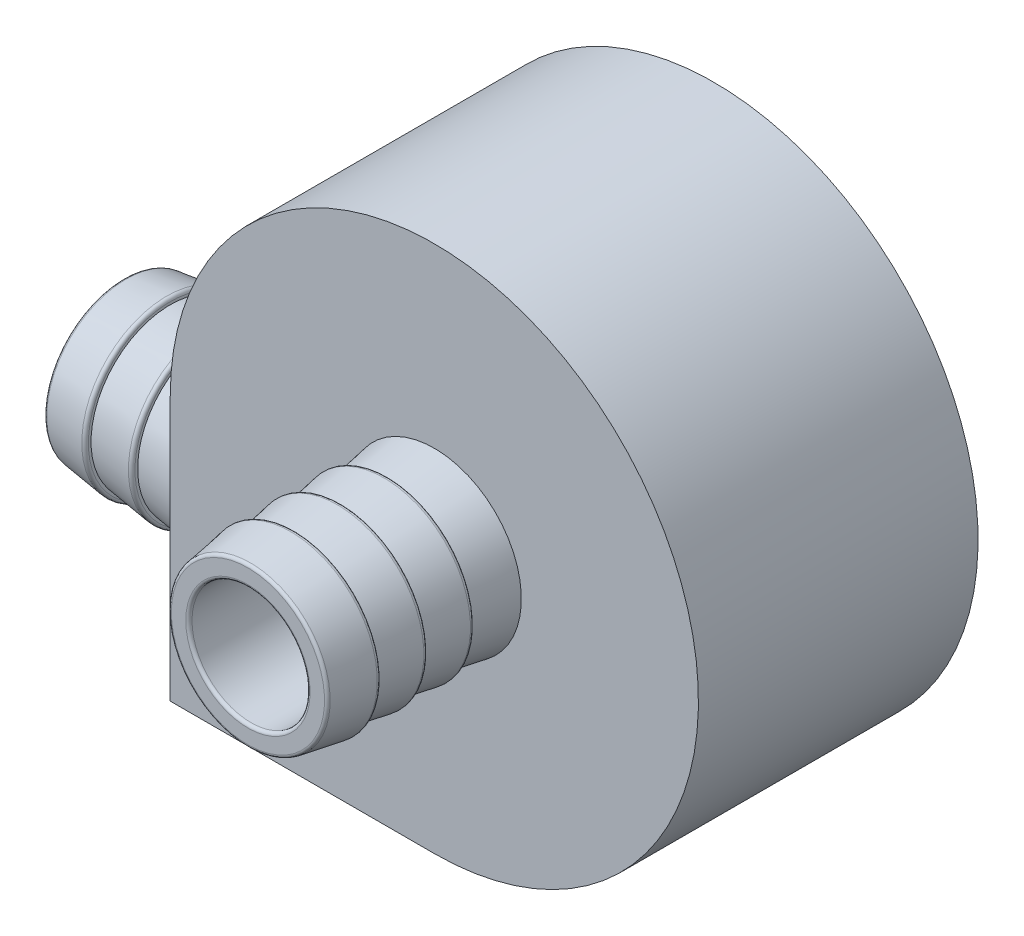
from build123d import *

# Parameters (mm, degrees)
BOSS_EXTRUDE1_DEPTH = 22.86
SKETCH4_R           = 4.826
CUT_EXTRUDE1_DEPTH  = 39.142309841
SKETCH7_R           = 17.156517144
CUT_EXTRUDE2_DEPTH  = 20.32
SKETCH9_R           = 4.953
CUT_EXTRUDE3_DEPTH  = 12.7


with BuildPart() as part:
    # Sketch1 → Boss-Extrude1 (new body)
    with BuildSketch(Plane.XY):
        with BuildLine():
            Line((0, -21.59), (-21.59, -21.59))
            Line((-21.59, -21.59), (-21.59, 0))
            ThreePointArc((-21.59, 0), (15.266435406, 15.266435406), (0, -21.59))
        make_face()
    extrude(amount=BOSS_EXTRUDE1_DEPTH)

    # Sketch3 → Revolve1 (revolve)
    with BuildSketch(Plane(origin=(0, 0, 0), x_dir=(1, 0, 0), z_dir=(0, 1, 0)), mode=Mode.PRIVATE) as revolve1_sk:
        with BuildLine():
            Line((4.826, -22.86), (7.112, -22.86))
            Line((7.112, -22.86), (6.477, -26.67))
            Line((6.477, -26.67), (6.812163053, -26.67))
            ThreePointArc((6.812163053, -26.67), (7.005970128, -26.759820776), (7.06270711, -26.965757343))
            Line((7.06270711, -26.965757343), (6.477, -30.48))
            Line((6.477, -30.48), (6.812163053, -30.48))
            ThreePointArc((6.812163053, -30.48), (7.005970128, -30.569820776), (7.06270711, -30.775757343))
            Line((7.06270711, -30.775757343), (6.477, -34.29))
            Line((6.477, -34.29), (6.812163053, -34.29))
            ThreePointArc((6.812163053, -34.29), (7.005970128, -34.379820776), (7.06270711, -34.585757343))
            Line((7.06270711, -34.585757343), (6.512373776, -37.887757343))
            ThreePointArc((6.512373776, -37.887757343), (6.426008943, -38.039807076), (6.26182972, -38.1))
            Line((6.26182972, -38.1), (5.08, -38.1))
            ThreePointArc((5.08, -38.1), (4.900394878, -38.025605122), (4.826, -37.846))
            Line((4.826, -37.846), (4.826, -22.86))
        make_face()
    revolve(revolve1_sk.sketch.rotate(Axis((0, 0, 22.86), (0, 0, 1)), 180), axis=Axis((0, 0, 22.86), (0, 0, 1)))

    # Sketch4 → Cut-Extrude1 (cut, through all)
    with BuildSketch(Plane.XY.offset(22.86)):
        with Locations(Location((0, 0, 0), (0, 0, 180))):
            Circle(SKETCH4_R)
    extrude(amount=-CUT_EXTRUDE1_DEPTH, mode=Mode.SUBTRACT)

    # Sketch7 → Cut-Extrude2 (cut)
    with BuildSketch(Plane(origin=(0, 0, 0), x_dir=(-1, 0, 0), z_dir=(0, 0, -1))):
        Circle(SKETCH7_R)
    extrude(amount=-CUT_EXTRUDE2_DEPTH, mode=Mode.SUBTRACT)

    # Sketch8 → Revolve3 (revolve)
    with BuildSketch(Plane.XZ.offset(11.43)):
        with BuildLine():
            Line((-21.59, 6.477), (-36.576, 6.477))
            ThreePointArc((-36.576, 6.477), (-36.755605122, 6.402605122), (-36.83, 6.223))
            Line((-36.83, 6.223), (-36.83, 5.175381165))
            ThreePointArc((-36.83, 5.175381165), (-36.767105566, 5.008065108), (-36.609569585, 4.923609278))
            Line((-36.609569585, 4.923609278), (-33.307569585, 4.483342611))
            ThreePointArc((-33.307569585, 4.483342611), (-33.106683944, 4.544008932), (-33.02, 4.735114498))
            Line((-33.02, 4.735114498), (-33.02, 4.953))
            Line((-33.02, 4.953), (-29.497569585, 4.483342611))
            ThreePointArc((-29.497569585, 4.483342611), (-29.296683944, 4.544008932), (-29.21, 4.735114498))
            Line((-29.21, 4.735114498), (-29.21, 4.953))
            Line((-29.21, 4.953), (-25.687569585, 4.483342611))
            ThreePointArc((-25.687569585, 4.483342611), (-25.486683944, 4.544008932), (-25.4, 4.735114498))
            Line((-25.4, 4.735114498), (-25.4, 4.953))
            Line((-25.4, 4.953), (-21.59, 4.445))
            Line((-21.59, 4.445), (-21.59, 6.477))
        make_face()
    revolve(axis=Axis((-21.59, -11.43, 11.43), (-1, 0, 0)))

    # Sketch9 → Cut-Extrude3 (cut)
    with BuildSketch(Plane.ZY.offset(21.59)):
        with Locations(Location((11.43, -11.43, 0), (0, 0, 180))):
            Circle(SKETCH9_R)
    extrude(amount=-CUT_EXTRUDE3_DEPTH, mode=Mode.SUBTRACT)


solid = part.part
